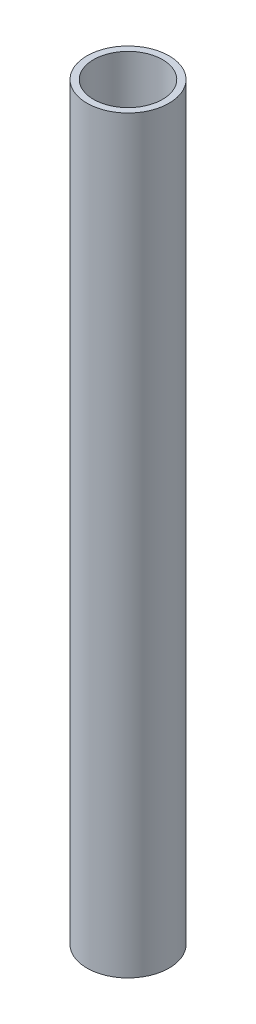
ISO-10303-21;
HEADER;
FILE_DESCRIPTION(('STEP AP214'),'2;1');
FILE_NAME('part.step','',(''),(''),'','','');
FILE_SCHEMA(('AUTOMOTIVE_DESIGN { 1 0 10303 214 1 1 1 1 }'));
ENDSEC;
DATA;
#1=APPLICATION_CONTEXT('core data for automotive mechanical design processes');
#2=APPLICATION_PROTOCOL_DEFINITION('international standard','automotive_design',2000,#1);
#3=PRODUCT_CONTEXT('',#1,'mechanical');
#4=PRODUCT('Part','Part','',(#3));
#5=PRODUCT_RELATED_PRODUCT_CATEGORY('part','',(#4));
#6=PRODUCT_DEFINITION_FORMATION('','',#4);
#7=PRODUCT_DEFINITION_CONTEXT('part definition',#1,'design');
#8=PRODUCT_DEFINITION('design','',#6,#7);
#9=PRODUCT_DEFINITION_SHAPE('','',#8);
#10=(LENGTH_UNIT() NAMED_UNIT(*) SI_UNIT(.MILLI.,.METRE.));
#11=(NAMED_UNIT(*) PLANE_ANGLE_UNIT() SI_UNIT($,.RADIAN.));
#12=(NAMED_UNIT(*) SI_UNIT($,.STERADIAN.) SOLID_ANGLE_UNIT());
#13=UNCERTAINTY_MEASURE_WITH_UNIT(LENGTH_MEASURE(1.E-05),#10,'distance_accuracy_value','');
#14=(GEOMETRIC_REPRESENTATION_CONTEXT(3) GLOBAL_UNCERTAINTY_ASSIGNED_CONTEXT((#13)) GLOBAL_UNIT_ASSIGNED_CONTEXT((#10,
#11,#12)) REPRESENTATION_CONTEXT('',''));
#15=CARTESIAN_POINT('',(0.,0.,0.));
#16=DIRECTION('',(0.,0.,1.));
#17=DIRECTION('',(1.,0.,0.));
#18=AXIS2_PLACEMENT_3D('',#15,#16,#17);
#19=CARTESIAN_POINT('',(0.,228.,0.));
#20=DIRECTION('',(0.,1.,0.));
#21=DIRECTION('',(0.,0.,1.));
#22=AXIS2_PLACEMENT_3D('',#19,#20,#21);
#23=PLANE('',#22);
#24=CARTESIAN_POINT('',(0.,228.,0.));
#25=DIRECTION('',(0.,1.,0.));
#26=DIRECTION('',(0.,0.,1.));
#27=AXIS2_PLACEMENT_3D('',#24,#25,#26);
#28=CIRCLE('',#27,12.5);
#29=CARTESIAN_POINT('',(0.,228.,-12.5));
#30=VERTEX_POINT('',#29);
#31=EDGE_CURVE('E10',#30,#30,#28,.T.);
#32=ORIENTED_EDGE('',*,*,#31,.T.);
#33=EDGE_LOOP('',(#32));
#34=FACE_BOUND('',#33,.T.);
#35=CARTESIAN_POINT('',(0.,228.,0.));
#36=DIRECTION('',(0.,1.,0.));
#37=DIRECTION('',(0.,0.,1.));
#38=AXIS2_PLACEMENT_3D('',#35,#36,#37);
#39=CIRCLE('',#38,10.5);
#40=CARTESIAN_POINT('',(0.,228.,-10.5));
#41=VERTEX_POINT('',#40);
#42=EDGE_CURVE('E56',#41,#41,#39,.T.);
#43=ORIENTED_EDGE('',*,*,#42,.F.);
#44=EDGE_LOOP('',(#43));
#45=FACE_BOUND('',#44,.T.);
#46=ADVANCED_FACE('F43',(#34,#45),#23,.T.);
#47=CARTESIAN_POINT('',(0.,0.,0.));
#48=DIRECTION('',(0.,1.,0.));
#49=DIRECTION('',(0.,0.,1.));
#50=AXIS2_PLACEMENT_3D('',#47,#48,#49);
#51=PLANE('',#50);
#52=CARTESIAN_POINT('',(0.,0.,0.));
#53=DIRECTION('',(0.,1.,0.));
#54=DIRECTION('',(0.,0.,1.));
#55=AXIS2_PLACEMENT_3D('',#52,#53,#54);
#56=CIRCLE('',#55,12.5);
#57=CARTESIAN_POINT('',(0.,0.,-12.5));
#58=VERTEX_POINT('',#57);
#59=EDGE_CURVE('E47',#58,#58,#56,.T.);
#60=ORIENTED_EDGE('',*,*,#59,.F.);
#61=EDGE_LOOP('',(#60));
#62=FACE_BOUND('',#61,.T.);
#63=CARTESIAN_POINT('',(0.,0.,0.));
#64=DIRECTION('',(0.,1.,0.));
#65=DIRECTION('',(0.,0.,1.));
#66=AXIS2_PLACEMENT_3D('',#63,#64,#65);
#67=CIRCLE('',#66,10.5);
#68=CARTESIAN_POINT('',(0.,0.,-10.5));
#69=VERTEX_POINT('',#68);
#70=EDGE_CURVE('E58',#69,#69,#67,.T.);
#71=ORIENTED_EDGE('',*,*,#70,.T.);
#72=EDGE_LOOP('',(#71));
#73=FACE_BOUND('',#72,.T.);
#74=ADVANCED_FACE('F70',(#62,#73),#51,.F.);
#75=CARTESIAN_POINT('',(0.,228.,0.));
#76=DIRECTION('',(0.,-1.,0.));
#77=DIRECTION('',(0.,0.,-1.));
#78=AXIS2_PLACEMENT_3D('',#75,#76,#77);
#79=CYLINDRICAL_SURFACE('',#78,12.5);
#80=CARTESIAN_POINT('',(0.,228.,-12.5));
#81=CARTESIAN_POINT('',(0.,225.625,-12.5));
#82=CARTESIAN_POINT('',(0.,223.25,-12.5));
#83=CARTESIAN_POINT('',(0.,218.5,-12.5));
#84=CARTESIAN_POINT('',(0.,216.125,-12.5));
#85=CARTESIAN_POINT('',(0.,211.375,-12.5));
#86=CARTESIAN_POINT('',(0.,209.,-12.5));
#87=CARTESIAN_POINT('',(0.,204.25,-12.5));
#88=CARTESIAN_POINT('',(0.,201.875,-12.5));
#89=CARTESIAN_POINT('',(0.,197.125,-12.5));
#90=CARTESIAN_POINT('',(0.,194.75,-12.5));
#91=CARTESIAN_POINT('',(0.,190.,-12.5));
#92=CARTESIAN_POINT('',(0.,187.625,-12.5));
#93=CARTESIAN_POINT('',(0.,182.875,-12.5));
#94=CARTESIAN_POINT('',(0.,180.5,-12.5));
#95=CARTESIAN_POINT('',(0.,175.75,-12.5));
#96=CARTESIAN_POINT('',(0.,173.375,-12.5));
#97=CARTESIAN_POINT('',(0.,168.625,-12.5));
#98=CARTESIAN_POINT('',(0.,166.25,-12.5));
#99=CARTESIAN_POINT('',(0.,161.5,-12.5));
#100=CARTESIAN_POINT('',(0.,159.125,-12.5));
#101=CARTESIAN_POINT('',(0.,154.375,-12.5));
#102=CARTESIAN_POINT('',(0.,152.,-12.5));
#103=CARTESIAN_POINT('',(0.,147.25,-12.5));
#104=CARTESIAN_POINT('',(0.,144.875,-12.5));
#105=CARTESIAN_POINT('',(0.,140.125,-12.5));
#106=CARTESIAN_POINT('',(0.,137.75,-12.5));
#107=CARTESIAN_POINT('',(0.,133.,-12.5));
#108=CARTESIAN_POINT('',(0.,130.625,-12.5));
#109=CARTESIAN_POINT('',(0.,125.875,-12.5));
#110=CARTESIAN_POINT('',(0.,123.5,-12.5));
#111=CARTESIAN_POINT('',(0.,118.75,-12.5));
#112=CARTESIAN_POINT('',(0.,116.375,-12.5));
#113=CARTESIAN_POINT('',(0.,111.625,-12.5));
#114=CARTESIAN_POINT('',(0.,109.25,-12.5));
#115=CARTESIAN_POINT('',(0.,104.5,-12.5));
#116=CARTESIAN_POINT('',(0.,102.125,-12.5));
#117=CARTESIAN_POINT('',(0.,97.375,-12.5));
#118=CARTESIAN_POINT('',(0.,95.,-12.5));
#119=CARTESIAN_POINT('',(0.,90.25,-12.5));
#120=CARTESIAN_POINT('',(0.,87.875,-12.5));
#121=CARTESIAN_POINT('',(0.,83.125,-12.5));
#122=CARTESIAN_POINT('',(0.,80.75,-12.5));
#123=CARTESIAN_POINT('',(0.,76.,-12.5));
#124=CARTESIAN_POINT('',(0.,73.625,-12.5));
#125=CARTESIAN_POINT('',(0.,68.875,-12.5));
#126=CARTESIAN_POINT('',(0.,66.5,-12.5));
#127=CARTESIAN_POINT('',(0.,61.75,-12.5));
#128=CARTESIAN_POINT('',(0.,59.375,-12.5));
#129=CARTESIAN_POINT('',(0.,54.625,-12.5));
#130=CARTESIAN_POINT('',(0.,52.25,-12.5));
#131=CARTESIAN_POINT('',(0.,47.5,-12.5));
#132=CARTESIAN_POINT('',(0.,45.125,-12.5));
#133=CARTESIAN_POINT('',(0.,40.375,-12.5));
#134=CARTESIAN_POINT('',(0.,38.,-12.5));
#135=CARTESIAN_POINT('',(0.,33.25,-12.5));
#136=CARTESIAN_POINT('',(0.,30.875,-12.5));
#137=CARTESIAN_POINT('',(0.,26.125,-12.5));
#138=CARTESIAN_POINT('',(0.,23.75,-12.5));
#139=CARTESIAN_POINT('',(0.,19.,-12.5));
#140=CARTESIAN_POINT('',(0.,16.625,-12.5));
#141=CARTESIAN_POINT('',(0.,11.875,-12.5));
#142=CARTESIAN_POINT('',(0.,9.5,-12.5));
#143=CARTESIAN_POINT('',(0.,4.75,-12.5));
#144=CARTESIAN_POINT('',(0.,2.375,-12.5));
#145=CARTESIAN_POINT('',(0.,0.,-12.5));
#146=B_SPLINE_CURVE_WITH_KNOTS('',3,(#80,#81,#82,#83,#84,#85,#86,#87,#88,#89,#90,#91,#92,#93,
#94,#95,#96,#97,#98,#99,#100,#101,#102,#103,#104,#105,#106,#107,#108,#109,#110,#111,#112,#113,
#114,#115,#116,#117,#118,#119,#120,#121,#122,#123,#124,#125,#126,#127,#128,#129,#130,#131,#132,
#133,#134,#135,#136,#137,#138,#139,#140,#141,#142,#143,#144,#145),.UNSPECIFIED.,.F.,.F.,(4,2,2,
2,2,2,2,2,2,2,2,2,2,2,2,2,2,2,2,2,2,2,2,2,2,2,2,2,2,2,2,2,4),(0.,7.12500000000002,14.25,21.375,
28.5,35.625,42.75,49.875,57.,64.125,71.25,78.375,85.5,92.625,99.75,106.875,114.,121.125,128.25,
135.375,142.5,149.625,156.75,163.875,171.,178.125,185.25,192.375,199.5,206.625,213.75,220.875,
228.),.UNSPECIFIED.);
#147=EDGE_CURVE('BSEAM45',#30,#58,#146,.T.);
#148=ORIENTED_EDGE('',*,*,#31,.F.);
#149=ORIENTED_EDGE('',*,*,#59,.T.);
#150=ORIENTED_EDGE('',*,*,#147,.T.);
#151=ORIENTED_EDGE('',*,*,#147,.F.);
#152=EDGE_LOOP('',(#148,#150,#149,#151));
#153=FACE_BOUND('',#152,.T.);
#154=ADVANCED_FACE('F45',(#153),#79,.T.);
#155=CARTESIAN_POINT('',(0.,228.,0.));
#156=DIRECTION('',(0.,-1.,0.));
#157=DIRECTION('',(0.,0.,-1.));
#158=AXIS2_PLACEMENT_3D('',#155,#156,#157);
#159=CYLINDRICAL_SURFACE('',#158,10.5);
#160=CARTESIAN_POINT('',(0.,228.,-10.5));
#161=CARTESIAN_POINT('',(0.,225.625,-10.5));
#162=CARTESIAN_POINT('',(0.,223.25,-10.5));
#163=CARTESIAN_POINT('',(0.,218.5,-10.5));
#164=CARTESIAN_POINT('',(0.,216.125,-10.5));
#165=CARTESIAN_POINT('',(0.,211.375,-10.5));
#166=CARTESIAN_POINT('',(0.,209.,-10.5));
#167=CARTESIAN_POINT('',(0.,204.25,-10.5));
#168=CARTESIAN_POINT('',(0.,201.875,-10.5));
#169=CARTESIAN_POINT('',(0.,197.125,-10.5));
#170=CARTESIAN_POINT('',(0.,194.75,-10.5));
#171=CARTESIAN_POINT('',(0.,190.,-10.5));
#172=CARTESIAN_POINT('',(0.,187.625,-10.5));
#173=CARTESIAN_POINT('',(0.,182.875,-10.5));
#174=CARTESIAN_POINT('',(0.,180.5,-10.5));
#175=CARTESIAN_POINT('',(0.,175.75,-10.5));
#176=CARTESIAN_POINT('',(0.,173.375,-10.5));
#177=CARTESIAN_POINT('',(0.,168.625,-10.5));
#178=CARTESIAN_POINT('',(0.,166.25,-10.5));
#179=CARTESIAN_POINT('',(0.,161.5,-10.5));
#180=CARTESIAN_POINT('',(0.,159.125,-10.5));
#181=CARTESIAN_POINT('',(0.,154.375,-10.5));
#182=CARTESIAN_POINT('',(0.,152.,-10.5));
#183=CARTESIAN_POINT('',(0.,147.25,-10.5));
#184=CARTESIAN_POINT('',(0.,144.875,-10.5));
#185=CARTESIAN_POINT('',(0.,140.125,-10.5));
#186=CARTESIAN_POINT('',(0.,137.75,-10.5));
#187=CARTESIAN_POINT('',(0.,133.,-10.5));
#188=CARTESIAN_POINT('',(0.,130.625,-10.5));
#189=CARTESIAN_POINT('',(0.,125.875,-10.5));
#190=CARTESIAN_POINT('',(0.,123.5,-10.5));
#191=CARTESIAN_POINT('',(0.,118.75,-10.5));
#192=CARTESIAN_POINT('',(0.,116.375,-10.5));
#193=CARTESIAN_POINT('',(0.,111.625,-10.5));
#194=CARTESIAN_POINT('',(0.,109.25,-10.5));
#195=CARTESIAN_POINT('',(0.,104.5,-10.5));
#196=CARTESIAN_POINT('',(0.,102.125,-10.5));
#197=CARTESIAN_POINT('',(0.,97.375,-10.5));
#198=CARTESIAN_POINT('',(0.,95.,-10.5));
#199=CARTESIAN_POINT('',(0.,90.25,-10.5));
#200=CARTESIAN_POINT('',(0.,87.875,-10.5));
#201=CARTESIAN_POINT('',(0.,83.125,-10.5));
#202=CARTESIAN_POINT('',(0.,80.75,-10.5));
#203=CARTESIAN_POINT('',(0.,76.,-10.5));
#204=CARTESIAN_POINT('',(0.,73.625,-10.5));
#205=CARTESIAN_POINT('',(0.,68.875,-10.5));
#206=CARTESIAN_POINT('',(0.,66.5,-10.5));
#207=CARTESIAN_POINT('',(0.,61.75,-10.5));
#208=CARTESIAN_POINT('',(0.,59.375,-10.5));
#209=CARTESIAN_POINT('',(0.,54.625,-10.5));
#210=CARTESIAN_POINT('',(0.,52.25,-10.5));
#211=CARTESIAN_POINT('',(0.,47.5,-10.5));
#212=CARTESIAN_POINT('',(0.,45.125,-10.5));
#213=CARTESIAN_POINT('',(0.,40.375,-10.5));
#214=CARTESIAN_POINT('',(0.,38.,-10.5));
#215=CARTESIAN_POINT('',(0.,33.25,-10.5));
#216=CARTESIAN_POINT('',(0.,30.875,-10.5));
#217=CARTESIAN_POINT('',(0.,26.125,-10.5));
#218=CARTESIAN_POINT('',(0.,23.75,-10.5));
#219=CARTESIAN_POINT('',(0.,19.,-10.5));
#220=CARTESIAN_POINT('',(0.,16.625,-10.5));
#221=CARTESIAN_POINT('',(0.,11.875,-10.5));
#222=CARTESIAN_POINT('',(0.,9.5,-10.5));
#223=CARTESIAN_POINT('',(0.,4.75,-10.5));
#224=CARTESIAN_POINT('',(0.,2.375,-10.5));
#225=CARTESIAN_POINT('',(0.,0.,-10.5));
#226=B_SPLINE_CURVE_WITH_KNOTS('',3,(#160,#161,#162,#163,#164,#165,#166,#167,#168,#169,#170,
#171,#172,#173,#174,#175,#176,#177,#178,#179,#180,#181,#182,#183,#184,#185,#186,#187,#188,#189,
#190,#191,#192,#193,#194,#195,#196,#197,#198,#199,#200,#201,#202,#203,#204,#205,#206,#207,#208,
#209,#210,#211,#212,#213,#214,#215,#216,#217,#218,#219,#220,#221,#222,#223,#224,#225),
.UNSPECIFIED.,.F.,.F.,(4,2,2,2,2,2,2,2,2,2,2,2,2,2,2,2,2,2,2,2,2,2,2,2,2,2,2,2,2,2,2,2,4),(0.,
7.12499999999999,14.25,21.375,28.5,35.625,42.75,49.875,57.,64.125,71.25,78.375,85.5,92.625,
99.75,106.875,114.,121.125,128.25,135.375,142.5,149.625,156.75,163.875,171.,178.125,185.25,
192.375,199.5,206.625,213.75,220.875,228.),.UNSPECIFIED.);
#227=EDGE_CURVE('BSEAM66',#41,#69,#226,.T.);
#228=ORIENTED_EDGE('',*,*,#42,.T.);
#229=ORIENTED_EDGE('',*,*,#70,.F.);
#230=ORIENTED_EDGE('',*,*,#227,.T.);
#231=ORIENTED_EDGE('',*,*,#227,.F.);
#232=EDGE_LOOP('',(#228,#230,#229,#231));
#233=FACE_BOUND('',#232,.T.);
#234=ADVANCED_FACE('F66',(#233),#159,.F.);
#235=CLOSED_SHELL('',(#46,#74,#154,#234));
#236=MANIFOLD_SOLID_BREP('B2',#235);
#237=ADVANCED_BREP_SHAPE_REPRESENTATION('',(#18,#236),#14);
#238=SHAPE_DEFINITION_REPRESENTATION(#9,#237);
ENDSEC;
END-ISO-10303-21;
